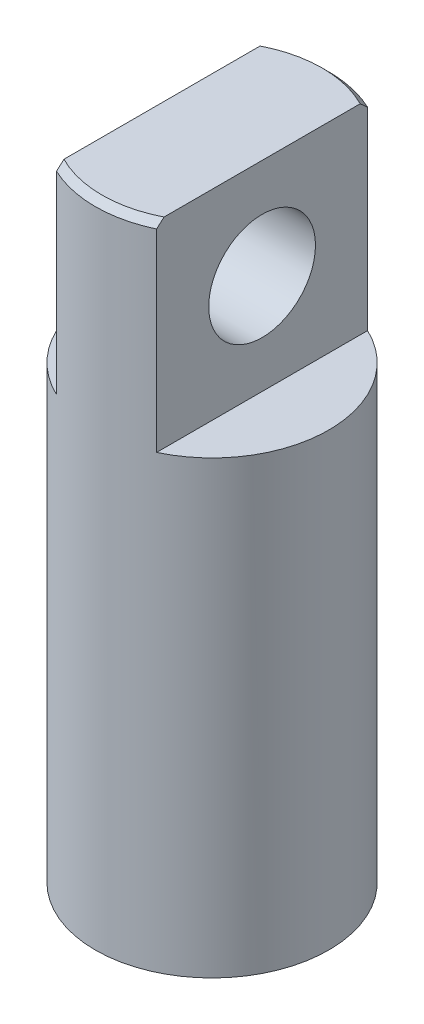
from build123d import *

# Parameters (mm, degrees)
SKETCH1_R           = 3.5
BOSS_EXTRUDE1_DEPTH = 13.5
BOSS_EXTRUDE2_START = 6
BOSS_EXTRUDE2_DEPTH = 6
SKETCH3_R           = 1.6
CUT_EXTRUDE1_DEPTH  = 3
CHAMFER1_SIZE       = 0.2


with BuildPart() as part:
    # Sketch1 → Boss-Extrude1 (new body)
    with BuildSketch(Plane(origin=(0, 0, 0), x_dir=(1, 0, 0), z_dir=(0, 1, 0))):
        with Locations(Location((0, 0, 0), (0, 0, 270))):
            Circle(SKETCH1_R)
    extrude(amount=-BOSS_EXTRUDE1_DEPTH)

    # Sketch2 → Boss-Extrude2 (add)
    with BuildSketch(Plane(origin=(0, 0, 0), x_dir=(1, 0, 0), z_dir=(0, 1, 0)).offset(BOSS_EXTRUDE2_START)):
        with BuildLine():
            Line((1.5, -3.16227766), (1.5, 3.16227766))
            ThreePointArc((1.5, 3.16227766), (0, 3.5), (-1.5, 3.16227766))
            Line((-1.5, 3.16227766), (-1.5, -3.16227766))
            ThreePointArc((-1.5, -3.16227766), (0, -3.5), (1.5, -3.16227766))
        make_face()
    extrude(amount=-BOSS_EXTRUDE2_DEPTH)

    # Sketch3 → Cut-Extrude1 (cut)
    with BuildSketch(Plane(origin=(1.5, 0, 0), x_dir=(0, 0, -1), z_dir=(1, 0, 0))):
        with Locations((0, 3)):
            Circle(SKETCH3_R)
    extrude(amount=-CUT_EXTRUDE1_DEPTH, mode=Mode.SUBTRACT)

    # Chamfer1
    chamfer1_edges = [part.edges().sort_by_distance(p)[0] for p in [
        (0, 6, 3.5),
        (0, 6, -3.5),
    ]]
    chamfer(chamfer1_edges, length=CHAMFER1_SIZE)


solid = part.part
